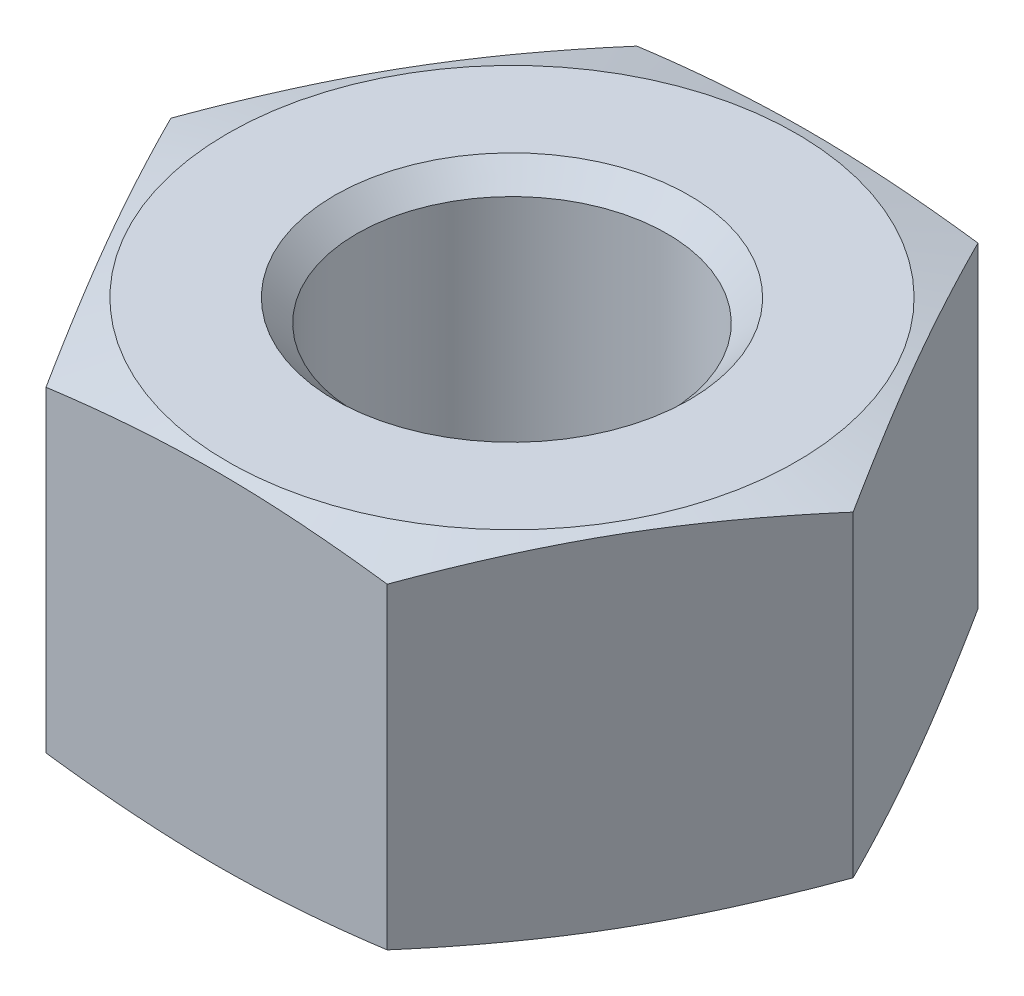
ISO-10303-21;
HEADER;
FILE_DESCRIPTION(('STEP AP214'),'2;1');
FILE_NAME('part.step','',(''),(''),'','','');
FILE_SCHEMA(('AUTOMOTIVE_DESIGN { 1 0 10303 214 1 1 1 1 }'));
ENDSEC;
DATA;
#1=APPLICATION_CONTEXT('core data for automotive mechanical design processes');
#2=APPLICATION_PROTOCOL_DEFINITION('international standard','automotive_design',2000,#1);
#3=PRODUCT_CONTEXT('',#1,'mechanical');
#4=PRODUCT('Part','Part','',(#3));
#5=PRODUCT_RELATED_PRODUCT_CATEGORY('part','',(#4));
#6=PRODUCT_DEFINITION_FORMATION('','',#4);
#7=PRODUCT_DEFINITION_CONTEXT('part definition',#1,'design');
#8=PRODUCT_DEFINITION('design','',#6,#7);
#9=PRODUCT_DEFINITION_SHAPE('','',#8);
#10=(LENGTH_UNIT() NAMED_UNIT(*) SI_UNIT(.MILLI.,.METRE.));
#11=(NAMED_UNIT(*) PLANE_ANGLE_UNIT() SI_UNIT($,.RADIAN.));
#12=(NAMED_UNIT(*) SI_UNIT($,.STERADIAN.) SOLID_ANGLE_UNIT());
#13=UNCERTAINTY_MEASURE_WITH_UNIT(LENGTH_MEASURE(1.E-05),#10,'distance_accuracy_value','');
#14=(GEOMETRIC_REPRESENTATION_CONTEXT(3) GLOBAL_UNCERTAINTY_ASSIGNED_CONTEXT((#13)) GLOBAL_UNIT_ASSIGNED_CONTEXT((#10,
#11,#12)) REPRESENTATION_CONTEXT('',''));
#15=CARTESIAN_POINT('',(0.,0.,0.));
#16=DIRECTION('',(0.,0.,1.));
#17=DIRECTION('',(1.,0.,0.));
#18=AXIS2_PLACEMENT_3D('',#15,#16,#17);
#19=CARTESIAN_POINT('',(-58.4,-22.,7.5));
#20=DIRECTION('',(0.,1.,0.));
#21=DIRECTION('',(1.,0.,0.));
#22=AXIS2_PLACEMENT_3D('',#19,#20,#21);
#23=CONICAL_SURFACE('',#22,2.4,0.785398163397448);
#24=CARTESIAN_POINT('',(-58.4,-22.3,7.5));
#25=DIRECTION('',(0.,1.,0.));
#26=DIRECTION('',(1.,0.,0.));
#27=AXIS2_PLACEMENT_3D('',#24,#25,#26);
#28=CIRCLE('',#27,2.1);
#29=CARTESIAN_POINT('',(-56.3,-22.3,7.5));
#30=VERTEX_POINT('',#29);
#31=EDGE_CURVE('E27',#30,#30,#28,.T.);
#32=ORIENTED_EDGE('',*,*,#31,.F.);
#33=EDGE_LOOP('',(#32));
#34=FACE_BOUND('',#33,.T.);
#35=CARTESIAN_POINT('',(-58.4,-22.,7.5));
#36=DIRECTION('',(0.,-1.,0.));
#37=DIRECTION('',(1.,0.,0.));
#38=AXIS2_PLACEMENT_3D('',#35,#36,#37);
#39=CIRCLE('',#38,2.4);
#40=CARTESIAN_POINT('',(-56.,-22.,7.5));
#41=VERTEX_POINT('',#40);
#42=EDGE_CURVE('E357',#41,#41,#39,.T.);
#43=ORIENTED_EDGE('',*,*,#42,.F.);
#44=EDGE_LOOP('',(#43));
#45=FACE_BOUND('',#44,.T.);
#46=ADVANCED_FACE('F16',(#34,#45),#23,.F.);
#47=CARTESIAN_POINT('',(-58.4,-26.4,7.5));
#48=DIRECTION('',(0.,-1.,0.));
#49=DIRECTION('',(-1.,0.,0.));
#50=AXIS2_PLACEMENT_3D('',#47,#48,#49);
#51=CONICAL_SURFACE('',#50,2.1,0.78539816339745);
#52=CARTESIAN_POINT('',(-58.4,-26.4,7.5));
#53=DIRECTION('',(0.,-1.,0.));
#54=DIRECTION('',(1.,0.,0.));
#55=AXIS2_PLACEMENT_3D('',#52,#53,#54);
#56=CIRCLE('',#55,2.1);
#57=CARTESIAN_POINT('',(-56.3,-26.4,7.5));
#58=VERTEX_POINT('',#57);
#59=EDGE_CURVE('E11',#58,#58,#56,.T.);
#60=ORIENTED_EDGE('',*,*,#59,.F.);
#61=EDGE_LOOP('',(#60));
#62=FACE_BOUND('',#61,.T.);
#63=CARTESIAN_POINT('',(-58.4,-26.7,7.5));
#64=DIRECTION('',(0.,1.,0.));
#65=DIRECTION('',(1.,0.,0.));
#66=AXIS2_PLACEMENT_3D('',#63,#64,#65);
#67=CIRCLE('',#66,2.4);
#68=CARTESIAN_POINT('',(-56.,-26.7,7.5));
#69=VERTEX_POINT('',#68);
#70=EDGE_CURVE('E348',#69,#69,#67,.T.);
#71=ORIENTED_EDGE('',*,*,#70,.F.);
#72=EDGE_LOOP('',(#71));
#73=FACE_BOUND('',#72,.T.);
#74=ADVANCED_FACE('F329',(#62,#73),#51,.F.);
#75=CARTESIAN_POINT('',(-58.4,-26.7,7.5));
#76=DIRECTION('',(0.,-1.,0.));
#77=DIRECTION('',(-1.,0.,0.));
#78=AXIS2_PLACEMENT_3D('',#75,#76,#77);
#79=CYLINDRICAL_SURFACE('',#78,2.1);
#80=ORIENTED_EDGE('',*,*,#59,.T.);
#81=EDGE_LOOP('',(#80));
#82=FACE_BOUND('',#81,.T.);
#83=ORIENTED_EDGE('',*,*,#31,.T.);
#84=EDGE_LOOP('',(#83));
#85=FACE_BOUND('',#84,.T.);
#86=ADVANCED_FACE('F200',(#82,#85),#79,.F.);
#87=CARTESIAN_POINT('',(-56.0905989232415,-22.,11.5));
#88=DIRECTION('',(0.,1.,0.));
#89=DIRECTION('',(1.,0.,0.));
#90=AXIS2_PLACEMENT_3D('',#87,#88,#89);
#91=PLANE('',#90);
#92=ORIENTED_EDGE('',*,*,#42,.T.);
#93=EDGE_LOOP('',(#92));
#94=FACE_BOUND('',#93,.T.);
#95=CARTESIAN_POINT('',(-58.4,-22.,7.5));
#96=DIRECTION('',(0.,-1.,0.));
#97=DIRECTION('',(-1.,0.,0.));
#98=AXIS2_PLACEMENT_3D('',#95,#96,#97);
#99=CIRCLE('',#98,3.85);
#100=CARTESIAN_POINT('',(-62.25,-22.,7.5));
#101=VERTEX_POINT('',#100);
#102=EDGE_CURVE('E351',#101,#101,#99,.T.);
#103=ORIENTED_EDGE('',*,*,#102,.F.);
#104=EDGE_LOOP('',(#103));
#105=FACE_BOUND('',#104,.T.);
#106=ADVANCED_FACE('F198',(#94,#105),#91,.T.);
#107=CARTESIAN_POINT('',(-58.4,-22.,7.5));
#108=DIRECTION('',(0.,-1.,0.));
#109=DIRECTION('',(-1.,0.,0.));
#110=AXIS2_PLACEMENT_3D('',#107,#108,#109);
#111=CONICAL_SURFACE('',#110,3.85,1.30899693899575);
#112=ORIENTED_EDGE('',*,*,#102,.T.);
#113=EDGE_LOOP('',(#112));
#114=FACE_BOUND('',#113,.T.);
#115=CARTESIAN_POINT('',(-53.781197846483,-22.2059999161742,7.5));
#116=CARTESIAN_POINT('',(-54.3998481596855,-22.0402330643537,8.5715337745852));
#117=CARTESIAN_POINT('',(-54.9358983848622,-22.0401923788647,9.5));
#118=CARTESIAN_POINT('',(-55.4716450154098,-22.040151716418,10.4279403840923));
#119=CARTESIAN_POINT('',(-56.0905989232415,-22.2059999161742,11.5));
#120=B_SPLINE_CURVE_WITH_KNOTS('',2,(#115,#116,#117,#118,#119),.UNSPECIFIED.,.F.,.F.,(3,2,3),
(0.,0.5,1.),.UNSPECIFIED.);
#121=CARTESIAN_POINT('',(-53.781197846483,-22.2059999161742,7.5));
#122=VERTEX_POINT('',#121);
#123=CARTESIAN_POINT('',(-56.0905989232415,-22.2059999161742,11.5));
#124=VERTEX_POINT('',#123);
#125=EDGE_CURVE('E151',#122,#124,#120,.T.);
#126=ORIENTED_EDGE('',*,*,#125,.F.);
#127=CARTESIAN_POINT('',(-56.0905989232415,-22.2059999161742,3.5));
#128=CARTESIAN_POINT('',(-55.471948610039,-22.0402330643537,4.57153377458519));
#129=CARTESIAN_POINT('',(-54.9358983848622,-22.0401923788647,5.5));
#130=CARTESIAN_POINT('',(-54.4001517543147,-22.040151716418,6.42794038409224));
#131=CARTESIAN_POINT('',(-53.781197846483,-22.2059999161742,7.5));
#132=B_SPLINE_CURVE_WITH_KNOTS('',2,(#127,#128,#129,#130,#131),.UNSPECIFIED.,.F.,.F.,(3,2,3),
(0.,0.5,1.),.UNSPECIFIED.);
#133=CARTESIAN_POINT('',(-56.0905989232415,-22.2059999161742,3.5));
#134=VERTEX_POINT('',#133);
#135=EDGE_CURVE('E138',#134,#122,#132,.T.);
#136=ORIENTED_EDGE('',*,*,#135,.F.);
#137=CARTESIAN_POINT('',(-60.7094010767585,-22.2059999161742,3.5));
#138=CARTESIAN_POINT('',(-59.4699107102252,-22.0399396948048,3.5));
#139=CARTESIAN_POINT('',(-58.3959536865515,-22.0401929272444,3.5));
#140=CARTESIAN_POINT('',(-57.3263165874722,-22.0404451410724,3.5));
#141=CARTESIAN_POINT('',(-56.0905989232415,-22.2059999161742,3.5));
#142=B_SPLINE_CURVE_WITH_KNOTS('',2,(#137,#138,#139,#140,#141),.UNSPECIFIED.,.F.,.F.,(3,2,3),
(0.,0.5,1.),.UNSPECIFIED.);
#143=CARTESIAN_POINT('',(-60.7094010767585,-22.2059999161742,3.5));
#144=VERTEX_POINT('',#143);
#145=EDGE_CURVE('E125',#144,#134,#142,.T.);
#146=ORIENTED_EDGE('',*,*,#145,.F.);
#147=CARTESIAN_POINT('',(-63.018802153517,-22.2059999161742,7.5));
#148=CARTESIAN_POINT('',(-62.4001518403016,-22.0402330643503,6.42846622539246));
#149=CARTESIAN_POINT('',(-61.8641016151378,-22.0401923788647,5.5));
#150=CARTESIAN_POINT('',(-61.3283549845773,-22.0401517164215,4.57205961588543));
#151=CARTESIAN_POINT('',(-60.7094010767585,-22.2059999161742,3.5));
#152=B_SPLINE_CURVE_WITH_KNOTS('',2,(#147,#148,#149,#150,#151),.UNSPECIFIED.,.F.,.F.,(3,2,3),
(0.,0.5,1.),.UNSPECIFIED.);
#153=CARTESIAN_POINT('',(-63.018802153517,-22.2059999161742,7.5));
#154=VERTEX_POINT('',#153);
#155=EDGE_CURVE('E387',#154,#144,#152,.T.);
#156=ORIENTED_EDGE('',*,*,#155,.F.);
#157=CARTESIAN_POINT('',(-60.7094010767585,-22.2059999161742,11.5));
#158=CARTESIAN_POINT('',(-61.3280513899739,-22.0402330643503,10.4284662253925));
#159=CARTESIAN_POINT('',(-61.8641016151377,-22.0401923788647,9.5));
#160=CARTESIAN_POINT('',(-62.3998482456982,-22.0401517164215,8.57205961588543));
#161=CARTESIAN_POINT('',(-63.018802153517,-22.2059999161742,7.5));
#162=B_SPLINE_CURVE_WITH_KNOTS('',2,(#157,#158,#159,#160,#161),.UNSPECIFIED.,.F.,.F.,(3,2,3),
(0.,0.5,1.),.UNSPECIFIED.);
#163=CARTESIAN_POINT('',(-60.7094010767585,-22.2059999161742,11.5));
#164=VERTEX_POINT('',#163);
#165=EDGE_CURVE('E270',#164,#154,#162,.T.);
#166=ORIENTED_EDGE('',*,*,#165,.F.);
#167=CARTESIAN_POINT('',(-56.0905989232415,-22.2059999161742,11.5));
#168=CARTESIAN_POINT('',(-57.3257437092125,-22.040521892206,11.5));
#169=CARTESIAN_POINT('',(-58.3959536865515,-22.0401929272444,11.5));
#170=CARTESIAN_POINT('',(-59.4693381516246,-22.0398629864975,11.5));
#171=CARTESIAN_POINT('',(-60.7094010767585,-22.2059999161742,11.5));
#172=B_SPLINE_CURVE_WITH_KNOTS('',2,(#167,#168,#169,#170,#171),.UNSPECIFIED.,.F.,.F.,(3,2,3),
(0.,0.5,1.),.UNSPECIFIED.);
#173=EDGE_CURVE('E269',#124,#164,#172,.T.);
#174=ORIENTED_EDGE('',*,*,#173,.F.);
#175=EDGE_LOOP('',(#126,#136,#146,#156,#166,#174));
#176=FACE_BOUND('',#175,.T.);
#177=ADVANCED_FACE('F190',(#114,#176),#111,.T.);
#178=CARTESIAN_POINT('',(-56.0905989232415,-26.7,11.5));
#179=DIRECTION('',(0.,1.,0.));
#180=DIRECTION('',(1.,0.,0.));
#181=AXIS2_PLACEMENT_3D('',#178,#179,#180);
#182=PLANE('',#181);
#183=ORIENTED_EDGE('',*,*,#70,.T.);
#184=EDGE_LOOP('',(#183));
#185=FACE_BOUND('',#184,.T.);
#186=CARTESIAN_POINT('',(-58.4,-26.7,7.5));
#187=DIRECTION('',(0.,-1.,0.));
#188=DIRECTION('',(-1.,0.,0.));
#189=AXIS2_PLACEMENT_3D('',#186,#187,#188);
#190=CIRCLE('',#189,3.85);
#191=CARTESIAN_POINT('',(-62.25,-26.7,7.5));
#192=VERTEX_POINT('',#191);
#193=EDGE_CURVE('E352',#192,#192,#190,.T.);
#194=ORIENTED_EDGE('',*,*,#193,.T.);
#195=EDGE_LOOP('',(#194));
#196=FACE_BOUND('',#195,.T.);
#197=ADVANCED_FACE('F172',(#185,#196),#182,.F.);
#198=CARTESIAN_POINT('',(-58.4,-26.4940000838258,7.5));
#199=DIRECTION('',(0.,1.,0.));
#200=DIRECTION('',(1.,0.,0.));
#201=AXIS2_PLACEMENT_3D('',#198,#199,#200);
#202=CONICAL_SURFACE('',#201,4.61880215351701,1.30899693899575);
#203=ORIENTED_EDGE('',*,*,#193,.F.);
#204=EDGE_LOOP('',(#203));
#205=FACE_BOUND('',#204,.T.);
#206=CARTESIAN_POINT('',(-63.018802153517,-26.4940000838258,7.5));
#207=CARTESIAN_POINT('',(-62.4001518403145,-26.6597669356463,8.57153377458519));
#208=CARTESIAN_POINT('',(-61.8641016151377,-26.6598076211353,9.5));
#209=CARTESIAN_POINT('',(-61.3283549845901,-26.659848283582,10.4279403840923));
#210=CARTESIAN_POINT('',(-60.7094010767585,-26.4940000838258,11.5));
#211=B_SPLINE_CURVE_WITH_KNOTS('',2,(#206,#207,#208,#209,#210),.UNSPECIFIED.,.F.,.F.,(3,2,3),
(0.,0.5,1.),.UNSPECIFIED.);
#212=CARTESIAN_POINT('',(-63.018802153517,-26.4940000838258,7.5));
#213=VERTEX_POINT('',#212);
#214=CARTESIAN_POINT('',(-60.7094010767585,-26.4940000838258,11.5));
#215=VERTEX_POINT('',#214);
#216=EDGE_CURVE('E359',#213,#215,#211,.T.);
#217=ORIENTED_EDGE('',*,*,#216,.F.);
#218=CARTESIAN_POINT('',(-60.7094010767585,-26.4940000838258,3.5));
#219=CARTESIAN_POINT('',(-61.328051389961,-26.6597669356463,4.57153377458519));
#220=CARTESIAN_POINT('',(-61.8641016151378,-26.6598076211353,5.5));
#221=CARTESIAN_POINT('',(-62.3998482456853,-26.659848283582,6.42794038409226));
#222=CARTESIAN_POINT('',(-63.018802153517,-26.4940000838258,7.5));
#223=B_SPLINE_CURVE_WITH_KNOTS('',2,(#218,#219,#220,#221,#222),.UNSPECIFIED.,.F.,.F.,(3,2,3),
(0.,0.5,1.),.UNSPECIFIED.);
#224=CARTESIAN_POINT('',(-60.7094010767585,-26.4940000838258,3.5));
#225=VERTEX_POINT('',#224);
#226=EDGE_CURVE('E116',#225,#213,#223,.T.);
#227=ORIENTED_EDGE('',*,*,#226,.F.);
#228=CARTESIAN_POINT('',(-56.0905989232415,-26.4940000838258,3.5));
#229=CARTESIAN_POINT('',(-57.3257437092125,-26.659478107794,3.5));
#230=CARTESIAN_POINT('',(-58.3959536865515,-26.6598070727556,3.5));
#231=CARTESIAN_POINT('',(-59.4693381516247,-26.6601370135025,3.5));
#232=CARTESIAN_POINT('',(-60.7094010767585,-26.4940000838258,3.5));
#233=B_SPLINE_CURVE_WITH_KNOTS('',2,(#228,#229,#230,#231,#232),.UNSPECIFIED.,.F.,.F.,(3,2,3),
(0.,0.5,1.),.UNSPECIFIED.);
#234=CARTESIAN_POINT('',(-56.0905989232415,-26.4940000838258,3.5));
#235=VERTEX_POINT('',#234);
#236=EDGE_CURVE('E108',#235,#225,#233,.T.);
#237=ORIENTED_EDGE('',*,*,#236,.F.);
#238=CARTESIAN_POINT('',(-53.781197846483,-26.4940000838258,7.5));
#239=CARTESIAN_POINT('',(-54.3998481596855,-26.6597669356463,6.42846622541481));
#240=CARTESIAN_POINT('',(-54.9358983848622,-26.6598076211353,5.5));
#241=CARTESIAN_POINT('',(-55.4716450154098,-26.659848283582,4.57205961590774));
#242=CARTESIAN_POINT('',(-56.0905989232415,-26.4940000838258,3.5));
#243=B_SPLINE_CURVE_WITH_KNOTS('',2,(#238,#239,#240,#241,#242),.UNSPECIFIED.,.F.,.F.,(3,2,3),
(0.,0.5,1.),.UNSPECIFIED.);
#244=CARTESIAN_POINT('',(-53.781197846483,-26.4940000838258,7.5));
#245=VERTEX_POINT('',#244);
#246=EDGE_CURVE('E112',#245,#235,#243,.T.);
#247=ORIENTED_EDGE('',*,*,#246,.F.);
#248=CARTESIAN_POINT('',(-56.0905989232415,-26.4940000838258,11.5));
#249=CARTESIAN_POINT('',(-55.4719486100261,-26.6597669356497,10.4284662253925));
#250=CARTESIAN_POINT('',(-54.9358983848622,-26.6598076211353,9.5));
#251=CARTESIAN_POINT('',(-54.4001517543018,-26.6598482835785,8.57205961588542));
#252=CARTESIAN_POINT('',(-53.781197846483,-26.4940000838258,7.5));
#253=B_SPLINE_CURVE_WITH_KNOTS('',2,(#248,#249,#250,#251,#252),.UNSPECIFIED.,.F.,.F.,(3,2,3),
(0.,0.5,1.),.UNSPECIFIED.);
#254=CARTESIAN_POINT('',(-56.0905989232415,-26.4940000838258,11.5));
#255=VERTEX_POINT('',#254);
#256=EDGE_CURVE('E146',#255,#245,#253,.T.);
#257=ORIENTED_EDGE('',*,*,#256,.F.);
#258=CARTESIAN_POINT('',(-60.7094010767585,-26.4940000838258,11.5));
#259=CARTESIAN_POINT('',(-59.4699107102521,-26.6600603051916,11.5));
#260=CARTESIAN_POINT('',(-58.3959536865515,-26.6598070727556,11.5));
#261=CARTESIAN_POINT('',(-57.3263165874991,-26.6595548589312,11.5));
#262=CARTESIAN_POINT('',(-56.0905989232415,-26.4940000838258,11.5));
#263=B_SPLINE_CURVE_WITH_KNOTS('',2,(#258,#259,#260,#261,#262),.UNSPECIFIED.,.F.,.F.,(3,2,3),
(0.,0.5,1.),.UNSPECIFIED.);
#264=EDGE_CURVE('E236',#215,#255,#263,.T.);
#265=ORIENTED_EDGE('',*,*,#264,.F.);
#266=EDGE_LOOP('',(#217,#227,#237,#247,#257,#265));
#267=FACE_BOUND('',#266,.T.);
#268=ADVANCED_FACE('F111',(#205,#267),#202,.T.);
#269=CARTESIAN_POINT('',(-63.018802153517,-22.,7.5));
#270=DIRECTION('',(0.866025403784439,0.,-0.5));
#271=DIRECTION('',(0.,-1.,0.));
#272=AXIS2_PLACEMENT_3D('',#269,#270,#271);
#273=PLANE('',#272);
#274=DIRECTION('',(0.,-1.,0.));
#275=VECTOR('',#274,1.);
#276=CARTESIAN_POINT('',(-60.7094010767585,-22.,11.5));
#277=LINE('',#276,#275);
#278=EDGE_CURVE('E273',#164,#215,#277,.T.);
#279=ORIENTED_EDGE('',*,*,#278,.F.);
#280=ORIENTED_EDGE('',*,*,#165,.T.);
#281=DIRECTION('',(0.,-1.,0.));
#282=VECTOR('',#281,1.);
#283=CARTESIAN_POINT('',(-63.018802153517,-22.,7.5));
#284=LINE('',#283,#282);
#285=EDGE_CURVE('E124',#154,#213,#284,.T.);
#286=ORIENTED_EDGE('',*,*,#285,.T.);
#287=ORIENTED_EDGE('',*,*,#216,.T.);
#288=EDGE_LOOP('',(#279,#280,#286,#287));
#289=FACE_BOUND('',#288,.T.);
#290=ADVANCED_FACE('F174',(#289),#273,.F.);
#291=CARTESIAN_POINT('',(-60.7094010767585,-22.,3.5));
#292=DIRECTION('',(0.866025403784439,0.,0.5));
#293=DIRECTION('',(0.,-1.,0.));
#294=AXIS2_PLACEMENT_3D('',#291,#292,#293);
#295=PLANE('',#294);
#296=ORIENTED_EDGE('',*,*,#285,.F.);
#297=ORIENTED_EDGE('',*,*,#155,.T.);
#298=DIRECTION('',(0.,-1.,0.));
#299=VECTOR('',#298,1.);
#300=CARTESIAN_POINT('',(-60.7094010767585,-22.,3.5));
#301=LINE('',#300,#299);
#302=EDGE_CURVE('E137',#144,#225,#301,.T.);
#303=ORIENTED_EDGE('',*,*,#302,.T.);
#304=ORIENTED_EDGE('',*,*,#226,.T.);
#305=EDGE_LOOP('',(#296,#297,#303,#304));
#306=FACE_BOUND('',#305,.T.);
#307=ADVANCED_FACE('F171',(#306),#295,.F.);
#308=CARTESIAN_POINT('',(-56.0905989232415,-22.,3.5));
#309=DIRECTION('',(0.,0.,1.));
#310=DIRECTION('',(0.,-1.,0.));
#311=AXIS2_PLACEMENT_3D('',#308,#309,#310);
#312=PLANE('',#311);
#313=ORIENTED_EDGE('',*,*,#302,.F.);
#314=ORIENTED_EDGE('',*,*,#145,.T.);
#315=DIRECTION('',(0.,-1.,0.));
#316=VECTOR('',#315,1.);
#317=CARTESIAN_POINT('',(-56.0905989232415,-22.,3.5));
#318=LINE('',#317,#316);
#319=EDGE_CURVE('E133',#134,#235,#318,.T.);
#320=ORIENTED_EDGE('',*,*,#319,.T.);
#321=ORIENTED_EDGE('',*,*,#236,.T.);
#322=EDGE_LOOP('',(#313,#314,#320,#321));
#323=FACE_BOUND('',#322,.T.);
#324=ADVANCED_FACE('F141',(#323),#312,.F.);
#325=CARTESIAN_POINT('',(-53.781197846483,-22.,7.5));
#326=DIRECTION('',(-0.866025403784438,0.,0.5));
#327=DIRECTION('',(-0.5,0.,-0.866025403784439));
#328=AXIS2_PLACEMENT_3D('',#325,#326,#327);
#329=PLANE('',#328);
#330=ORIENTED_EDGE('',*,*,#319,.F.);
#331=ORIENTED_EDGE('',*,*,#135,.T.);
#332=DIRECTION('',(0.,-1.,0.));
#333=VECTOR('',#332,1.);
#334=CARTESIAN_POINT('',(-53.781197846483,-22.,7.5));
#335=LINE('',#334,#333);
#336=EDGE_CURVE('E135',#122,#245,#335,.T.);
#337=ORIENTED_EDGE('',*,*,#336,.T.);
#338=ORIENTED_EDGE('',*,*,#246,.T.);
#339=EDGE_LOOP('',(#330,#331,#337,#338));
#340=FACE_BOUND('',#339,.T.);
#341=ADVANCED_FACE('F132',(#340),#329,.F.);
#342=CARTESIAN_POINT('',(-56.0905989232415,-22.,11.5));
#343=DIRECTION('',(-0.866025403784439,0.,-0.5));
#344=DIRECTION('',(0.,1.,0.));
#345=AXIS2_PLACEMENT_3D('',#342,#343,#344);
#346=PLANE('',#345);
#347=ORIENTED_EDGE('',*,*,#336,.F.);
#348=ORIENTED_EDGE('',*,*,#125,.T.);
#349=DIRECTION('',(0.,-1.,0.));
#350=VECTOR('',#349,1.);
#351=CARTESIAN_POINT('',(-56.0905989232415,-22.,11.5));
#352=LINE('',#351,#350);
#353=EDGE_CURVE('E274',#124,#255,#352,.T.);
#354=ORIENTED_EDGE('',*,*,#353,.T.);
#355=ORIENTED_EDGE('',*,*,#256,.T.);
#356=EDGE_LOOP('',(#347,#348,#354,#355));
#357=FACE_BOUND('',#356,.T.);
#358=ADVANCED_FACE('F253',(#357),#346,.F.);
#359=CARTESIAN_POINT('',(-60.7094010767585,-22.,11.5));
#360=DIRECTION('',(0.,0.,-1.));
#361=DIRECTION('',(1.,0.,0.));
#362=AXIS2_PLACEMENT_3D('',#359,#360,#361);
#363=PLANE('',#362);
#364=ORIENTED_EDGE('',*,*,#353,.F.);
#365=ORIENTED_EDGE('',*,*,#173,.T.);
#366=ORIENTED_EDGE('',*,*,#278,.T.);
#367=ORIENTED_EDGE('',*,*,#264,.T.);
#368=EDGE_LOOP('',(#364,#365,#366,#367));
#369=FACE_BOUND('',#368,.T.);
#370=ADVANCED_FACE('F243',(#369),#363,.F.);
#371=CLOSED_SHELL('',(#46,#74,#86,#106,#177,#197,#268,#290,#307,#324,#341,#358,#370));
#372=MANIFOLD_SOLID_BREP('B1',#371);
#373=ADVANCED_BREP_SHAPE_REPRESENTATION('',(#18,#372),#14);
#374=SHAPE_DEFINITION_REPRESENTATION(#9,#373);
ENDSEC;
END-ISO-10303-21;
